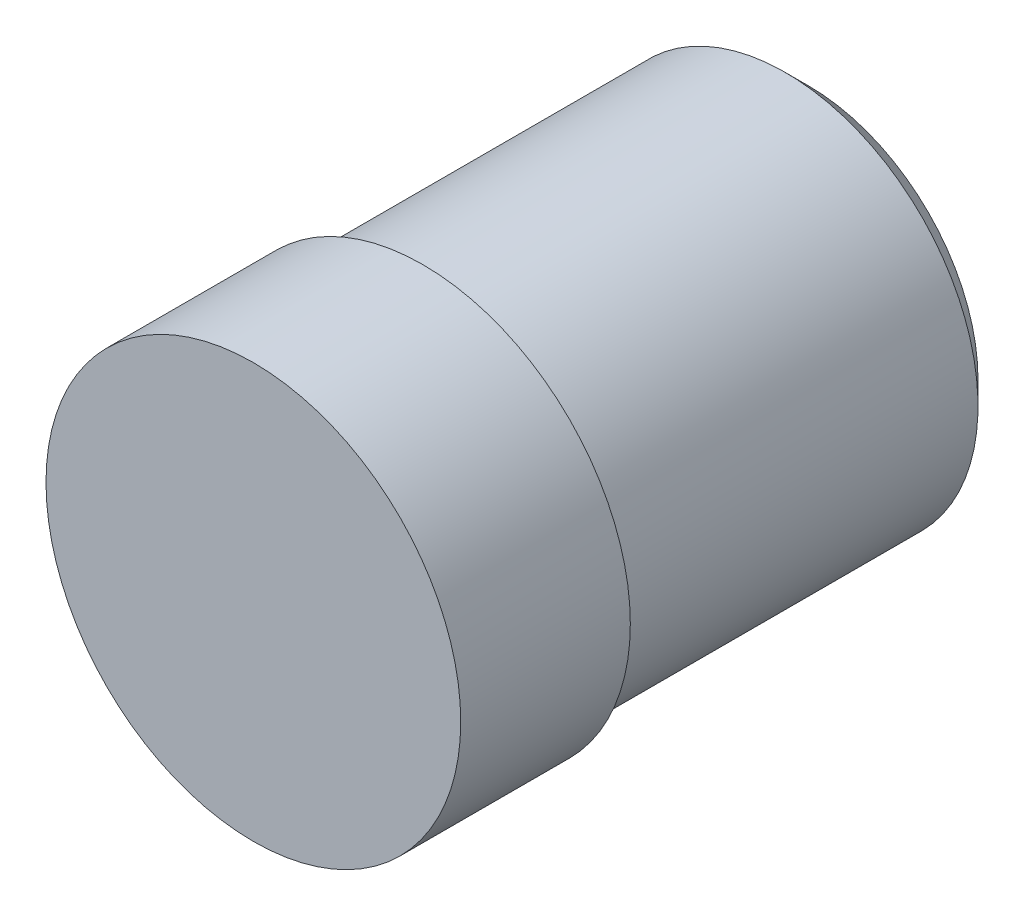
ISO-10303-21;
HEADER;
FILE_DESCRIPTION(('STEP AP214'),'2;1');
FILE_NAME('part.step','',(''),(''),'','','');
FILE_SCHEMA(('AUTOMOTIVE_DESIGN { 1 0 10303 214 1 1 1 1 }'));
ENDSEC;
DATA;
#1=APPLICATION_CONTEXT('core data for automotive mechanical design processes');
#2=APPLICATION_PROTOCOL_DEFINITION('international standard','automotive_design',2000,#1);
#3=PRODUCT_CONTEXT('',#1,'mechanical');
#4=PRODUCT('Part','Part','',(#3));
#5=PRODUCT_RELATED_PRODUCT_CATEGORY('part','',(#4));
#6=PRODUCT_DEFINITION_FORMATION('','',#4);
#7=PRODUCT_DEFINITION_CONTEXT('part definition',#1,'design');
#8=PRODUCT_DEFINITION('design','',#6,#7);
#9=PRODUCT_DEFINITION_SHAPE('','',#8);
#10=(LENGTH_UNIT() NAMED_UNIT(*) SI_UNIT(.MILLI.,.METRE.));
#11=(NAMED_UNIT(*) PLANE_ANGLE_UNIT() SI_UNIT($,.RADIAN.));
#12=(NAMED_UNIT(*) SI_UNIT($,.STERADIAN.) SOLID_ANGLE_UNIT());
#13=UNCERTAINTY_MEASURE_WITH_UNIT(LENGTH_MEASURE(1.E-05),#10,'distance_accuracy_value','');
#14=(GEOMETRIC_REPRESENTATION_CONTEXT(3) GLOBAL_UNCERTAINTY_ASSIGNED_CONTEXT((#13)) GLOBAL_UNIT_ASSIGNED_CONTEXT((#10,
#11,#12)) REPRESENTATION_CONTEXT('',''));
#15=CARTESIAN_POINT('',(0.,0.,0.));
#16=DIRECTION('',(0.,0.,1.));
#17=DIRECTION('',(1.,0.,0.));
#18=AXIS2_PLACEMENT_3D('',#15,#16,#17);
#19=CARTESIAN_POINT('',(-22.,0.,-72.));
#20=DIRECTION('',(0.,0.,1.));
#21=DIRECTION('',(1.,0.,0.));
#22=AXIS2_PLACEMENT_3D('',#19,#20,#21);
#23=PLANE('',#22);
#24=CARTESIAN_POINT('',(0.,0.,-72.));
#25=DIRECTION('',(0.,0.,-1.));
#26=DIRECTION('',(-1.,0.,0.));
#27=AXIS2_PLACEMENT_3D('',#24,#25,#26);
#28=CIRCLE('',#27,22.);
#29=CARTESIAN_POINT('',(-22.,0.,-72.));
#30=VERTEX_POINT('',#29);
#31=EDGE_CURVE('E10',#30,#30,#28,.T.);
#32=ORIENTED_EDGE('',*,*,#31,.T.);
#33=EDGE_LOOP('',(#32));
#34=FACE_BOUND('',#33,.T.);
#35=ADVANCED_FACE('F39',(#34),#23,.F.);
#36=CARTESIAN_POINT('',(0.,0.,-69.));
#37=DIRECTION('',(0.,0.,1.));
#38=DIRECTION('',(1.,0.,0.));
#39=AXIS2_PLACEMENT_3D('',#36,#37,#38);
#40=CONICAL_SURFACE('',#39,25.,0.785398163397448);
#41=ORIENTED_EDGE('',*,*,#31,.F.);
#42=EDGE_LOOP('',(#41));
#43=FACE_BOUND('',#42,.T.);
#44=CARTESIAN_POINT('',(0.,0.,-69.));
#45=DIRECTION('',(0.,0.,-1.));
#46=DIRECTION('',(-1.,0.,0.));
#47=AXIS2_PLACEMENT_3D('',#44,#45,#46);
#48=CIRCLE('',#47,25.);
#49=CARTESIAN_POINT('',(-25.,0.,-69.));
#50=VERTEX_POINT('',#49);
#51=EDGE_CURVE('E45',#50,#50,#48,.T.);
#52=ORIENTED_EDGE('',*,*,#51,.T.);
#53=EDGE_LOOP('',(#52));
#54=FACE_BOUND('',#53,.T.);
#55=ADVANCED_FACE('F74',(#43,#54),#40,.T.);
#56=CARTESIAN_POINT('',(0.,0.,-61.8321202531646));
#57=DIRECTION('',(0.,0.,-1.));
#58=DIRECTION('',(-1.,0.,0.));
#59=AXIS2_PLACEMENT_3D('',#56,#57,#58);
#60=CYLINDRICAL_SURFACE('',#59,25.);
#61=ORIENTED_EDGE('',*,*,#51,.F.);
#62=EDGE_LOOP('',(#61));
#63=FACE_BOUND('',#62,.T.);
#64=CARTESIAN_POINT('',(0.,0.,-22.));
#65=DIRECTION('',(0.,0.,-1.));
#66=DIRECTION('',(-1.,0.,0.));
#67=AXIS2_PLACEMENT_3D('',#64,#65,#66);
#68=CIRCLE('',#67,25.);
#69=CARTESIAN_POINT('',(-25.,0.,-22.));
#70=VERTEX_POINT('',#69);
#71=EDGE_CURVE('E49',#70,#70,#68,.T.);
#72=ORIENTED_EDGE('',*,*,#71,.T.);
#73=EDGE_LOOP('',(#72));
#74=FACE_BOUND('',#73,.T.);
#75=ADVANCED_FACE('F78',(#63,#74),#60,.T.);
#76=CARTESIAN_POINT('',(-26.9,0.,-22.));
#77=DIRECTION('',(0.,0.,1.));
#78=DIRECTION('',(1.,0.,0.));
#79=AXIS2_PLACEMENT_3D('',#76,#77,#78);
#80=PLANE('',#79);
#81=ORIENTED_EDGE('',*,*,#71,.F.);
#82=EDGE_LOOP('',(#81));
#83=FACE_BOUND('',#82,.T.);
#84=CARTESIAN_POINT('',(0.,0.,-22.));
#85=DIRECTION('',(0.,0.,-1.));
#86=DIRECTION('',(-1.,0.,0.));
#87=AXIS2_PLACEMENT_3D('',#84,#85,#86);
#88=CIRCLE('',#87,26.9);
#89=CARTESIAN_POINT('',(-26.9,0.,-22.));
#90=VERTEX_POINT('',#89);
#91=EDGE_CURVE('E53',#90,#90,#88,.T.);
#92=ORIENTED_EDGE('',*,*,#91,.T.);
#93=EDGE_LOOP('',(#92));
#94=FACE_BOUND('',#93,.T.);
#95=ADVANCED_FACE('F70',(#83,#94),#80,.F.);
#96=CARTESIAN_POINT('',(0.,0.,-61.8321202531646));
#97=DIRECTION('',(0.,0.,-1.));
#98=DIRECTION('',(-1.,0.,0.));
#99=AXIS2_PLACEMENT_3D('',#96,#97,#98);
#100=CYLINDRICAL_SURFACE('',#99,26.9);
#101=ORIENTED_EDGE('',*,*,#91,.F.);
#102=EDGE_LOOP('',(#101));
#103=FACE_BOUND('',#102,.T.);
#104=CARTESIAN_POINT('',(0.,0.,0.));
#105=DIRECTION('',(0.,0.,-1.));
#106=DIRECTION('',(-1.,0.,0.));
#107=AXIS2_PLACEMENT_3D('',#104,#105,#106);
#108=CIRCLE('',#107,26.9);
#109=CARTESIAN_POINT('',(-26.9,0.,0.));
#110=VERTEX_POINT('',#109);
#111=EDGE_CURVE('E58',#110,#110,#108,.T.);
#112=ORIENTED_EDGE('',*,*,#111,.T.);
#113=EDGE_LOOP('',(#112));
#114=FACE_BOUND('',#113,.T.);
#115=ADVANCED_FACE('F62',(#103,#114),#100,.T.);
#116=CARTESIAN_POINT('',(0.,0.,0.));
#117=DIRECTION('',(0.,0.,-1.));
#118=DIRECTION('',(-1.,0.,0.));
#119=AXIS2_PLACEMENT_3D('',#116,#117,#118);
#120=PLANE('',#119);
#121=ORIENTED_EDGE('',*,*,#111,.F.);
#122=EDGE_LOOP('',(#121));
#123=FACE_BOUND('',#122,.T.);
#124=ADVANCED_FACE('F64',(#123),#120,.F.);
#125=CLOSED_SHELL('',(#35,#55,#75,#95,#115,#124));
#126=MANIFOLD_SOLID_BREP('B2',#125);
#127=ADVANCED_BREP_SHAPE_REPRESENTATION('',(#18,#126),#14);
#128=SHAPE_DEFINITION_REPRESENTATION(#9,#127);
ENDSEC;
END-ISO-10303-21;
